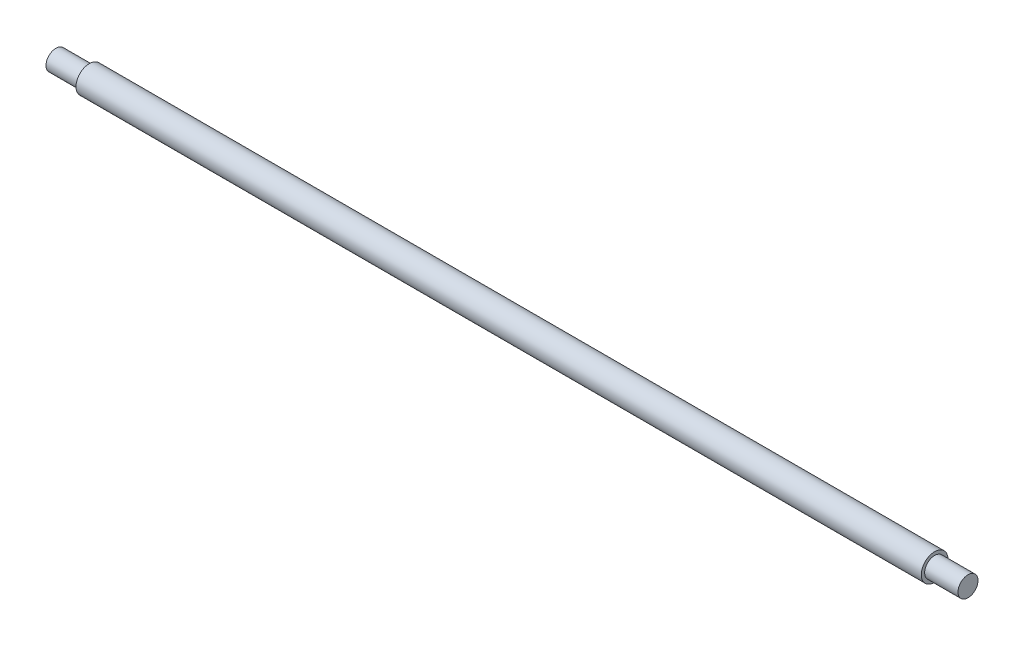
from build123d import *


with BuildPart() as part:
    # Esquisse1 → R_volution1 (revolve)
    with BuildSketch(Plane.XY, mode=Mode.PRIVATE) as r_volution1_sk:
        Polygon((-136.75, 0), (136.75, 0), (136.75, 3), (126.75, 3), (126.75, 4), (-126.75, 4), (-126.75, 3), (-136.75, 3), align=None)
    revolve(r_volution1_sk.sketch.rotate(Axis((-136.75, 0, 0), (1, 0, 0)), 180), axis=Axis((-136.75, 0, 0), (1, 0, 0)))


solid = part.part
